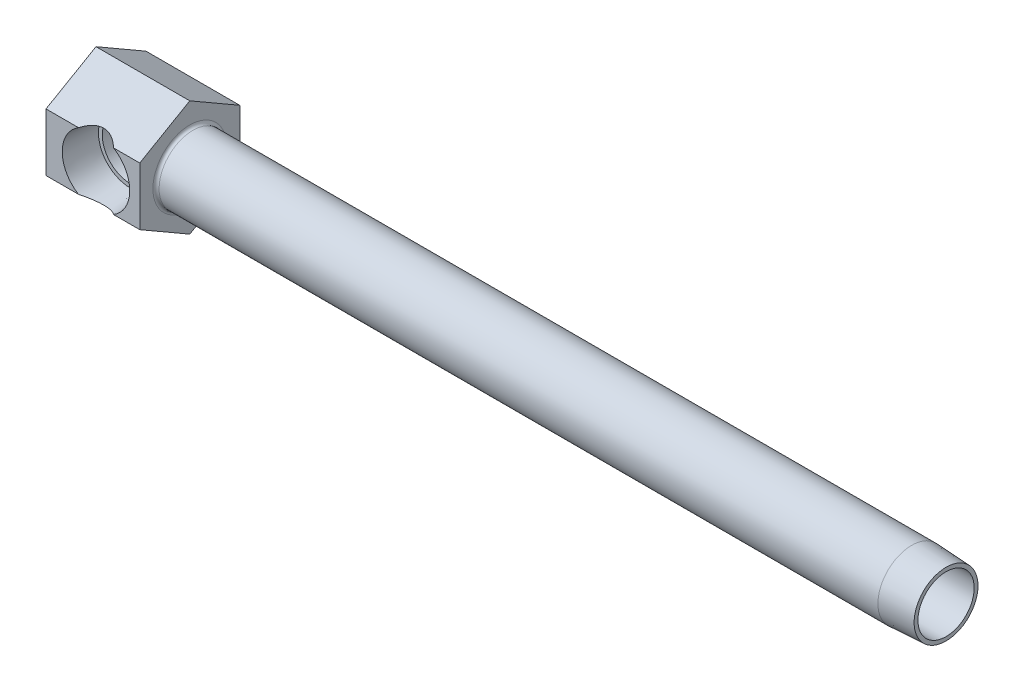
ISO-10303-21;
HEADER;
FILE_DESCRIPTION(('STEP AP214'),'2;1');
FILE_NAME('part.step','',(''),(''),'','','');
FILE_SCHEMA(('AUTOMOTIVE_DESIGN { 1 0 10303 214 1 1 1 1 }'));
ENDSEC;
DATA;
#1=APPLICATION_CONTEXT('core data for automotive mechanical design processes');
#2=APPLICATION_PROTOCOL_DEFINITION('international standard','automotive_design',2000,#1);
#3=PRODUCT_CONTEXT('',#1,'mechanical');
#4=PRODUCT('Part','Part','',(#3));
#5=PRODUCT_RELATED_PRODUCT_CATEGORY('part','',(#4));
#6=PRODUCT_DEFINITION_FORMATION('','',#4);
#7=PRODUCT_DEFINITION_CONTEXT('part definition',#1,'design');
#8=PRODUCT_DEFINITION('design','',#6,#7);
#9=PRODUCT_DEFINITION_SHAPE('','',#8);
#10=(LENGTH_UNIT() NAMED_UNIT(*) SI_UNIT(.MILLI.,.METRE.));
#11=(NAMED_UNIT(*) PLANE_ANGLE_UNIT() SI_UNIT($,.RADIAN.));
#12=(NAMED_UNIT(*) SI_UNIT($,.STERADIAN.) SOLID_ANGLE_UNIT());
#13=UNCERTAINTY_MEASURE_WITH_UNIT(LENGTH_MEASURE(1.E-05),#10,'distance_accuracy_value','');
#14=(GEOMETRIC_REPRESENTATION_CONTEXT(3) GLOBAL_UNCERTAINTY_ASSIGNED_CONTEXT((#13)) GLOBAL_UNIT_ASSIGNED_CONTEXT((#10,
#11,#12)) REPRESENTATION_CONTEXT('',''));
#15=CARTESIAN_POINT('',(0.,0.,0.));
#16=DIRECTION('',(0.,0.,1.));
#17=DIRECTION('',(1.,0.,0.));
#18=AXIS2_PLACEMENT_3D('',#15,#16,#17);
#19=CARTESIAN_POINT('',(63.5,0.,12.7));
#20=DIRECTION('',(-1.,0.,0.));
#21=DIRECTION('',(0.,-1.,0.));
#22=AXIS2_PLACEMENT_3D('',#19,#20,#21);
#23=CYLINDRICAL_SURFACE('',#22,8.5725);
#24=CARTESIAN_POINT('',(24.5999,0.,12.7));
#25=DIRECTION('',(-1.,0.,0.));
#26=DIRECTION('',(0.,-1.,0.));
#27=AXIS2_PLACEMENT_3D('',#24,#25,#26);
#28=CIRCLE('',#27,8.5725);
#29=CARTESIAN_POINT('',(24.5999,-8.57249999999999,12.7));
#30=VERTEX_POINT('',#29);
#31=EDGE_CURVE('E22',#30,#30,#28,.F.);
#32=ORIENTED_EDGE('',*,*,#31,.T.);
#33=EDGE_LOOP('',(#32));
#34=FACE_BOUND('',#33,.T.);
#35=CARTESIAN_POINT('',(207.1624,0.,12.7));
#36=DIRECTION('',(1.,0.,0.));
#37=DIRECTION('',(0.,0.,-1.));
#38=AXIS2_PLACEMENT_3D('',#35,#36,#37);
#39=CIRCLE('',#38,8.5725);
#40=CARTESIAN_POINT('',(207.1624,0.,4.1275));
#41=VERTEX_POINT('',#40);
#42=EDGE_CURVE('E153',#41,#41,#39,.T.);
#43=ORIENTED_EDGE('',*,*,#42,.F.);
#44=EDGE_LOOP('',(#43));
#45=FACE_BOUND('',#44,.T.);
#46=ADVANCED_FACE('F15',(#34,#45),#23,.T.);
#47=CARTESIAN_POINT('',(23.8125,14.6646968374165,12.7));
#48=DIRECTION('',(0.,-0.866025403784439,-0.5));
#49=DIRECTION('',(0.,0.5,-0.866025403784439));
#50=AXIS2_PLACEMENT_3D('',#47,#48,#49);
#51=PLANE('',#50);
#52=CARTESIAN_POINT('',(12.7,-0.84553451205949,39.56450873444));
#53=DIRECTION('',(0.,-0.866025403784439,-0.5));
#54=DIRECTION('',(0.,-0.5,0.866025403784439));
#55=AXIS2_PLACEMENT_3D('',#52,#53,#54);
#56=ELLIPSE('',#55,18.6296608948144,9.27637524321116);
#57=CARTESIAN_POINT('',(17.1412186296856,7.33234841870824,25.4));
#58=VERTEX_POINT('',#57);
#59=CARTESIAN_POINT('',(8.25878137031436,7.33234841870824,25.4));
#60=VERTEX_POINT('',#59);
#61=EDGE_CURVE('E232',#58,#60,#56,.F.);
#62=ORIENTED_EDGE('',*,*,#61,.F.);
#63=DIRECTION('',(-1.,0.,0.));
#64=VECTOR('',#63,1.);
#65=CARTESIAN_POINT('',(23.8125,7.33234841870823,25.4));
#66=LINE('',#65,#64);
#67=CARTESIAN_POINT('',(23.8125,7.33234841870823,25.4));
#68=VERTEX_POINT('',#67);
#69=EDGE_CURVE('E202',#68,#58,#66,.T.);
#70=ORIENTED_EDGE('',*,*,#69,.F.);
#71=DIRECTION('',(0.,-0.5,0.866025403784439));
#72=VECTOR('',#71,1.);
#73=CARTESIAN_POINT('',(23.8125,14.6646968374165,12.7));
#74=LINE('',#73,#72);
#75=CARTESIAN_POINT('',(23.8125,14.6646968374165,12.7));
#76=VERTEX_POINT('',#75);
#77=EDGE_CURVE('E222',#76,#68,#74,.T.);
#78=ORIENTED_EDGE('',*,*,#77,.F.);
#79=DIRECTION('',(-1.,0.,0.));
#80=VECTOR('',#79,1.);
#81=CARTESIAN_POINT('',(23.8125,14.6646968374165,12.7));
#82=LINE('',#81,#80);
#83=CARTESIAN_POINT('',(0.,14.6646968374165,12.7));
#84=VERTEX_POINT('',#83);
#85=EDGE_CURVE('E199',#76,#84,#82,.T.);
#86=ORIENTED_EDGE('',*,*,#85,.T.);
#87=DIRECTION('',(0.,-0.5,0.866025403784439));
#88=VECTOR('',#87,1.);
#89=CARTESIAN_POINT('',(0.,14.6646968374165,12.7));
#90=LINE('',#89,#88);
#91=CARTESIAN_POINT('',(0.,7.33234841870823,25.4));
#92=VERTEX_POINT('',#91);
#93=EDGE_CURVE('E239',#84,#92,#90,.T.);
#94=ORIENTED_EDGE('',*,*,#93,.T.);
#95=EDGE_CURVE('E205',#60,#92,#66,.T.);
#96=ORIENTED_EDGE('',*,*,#95,.F.);
#97=EDGE_LOOP('',(#62,#70,#78,#86,#94,#96));
#98=FACE_BOUND('',#97,.T.);
#99=ADVANCED_FACE('F173',(#98),#51,.F.);
#100=CARTESIAN_POINT('',(23.8125,7.33234841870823,25.4));
#101=DIRECTION('',(0.,0.,-1.));
#102=DIRECTION('',(-1.,0.,0.));
#103=AXIS2_PLACEMENT_3D('',#100,#101,#102);
#104=PLANE('',#103);
#105=CARTESIAN_POINT('',(12.7,0.,25.4));
#106=DIRECTION('',(0.,0.,-1.));
#107=DIRECTION('',(-1.,0.,0.));
#108=AXIS2_PLACEMENT_3D('',#105,#106,#107);
#109=CIRCLE('',#108,8.5725);
#110=CARTESIAN_POINT('',(17.1412186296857,-7.33234841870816,25.4));
#111=VERTEX_POINT('',#110);
#112=EDGE_CURVE('E249',#58,#111,#109,.T.);
#113=ORIENTED_EDGE('',*,*,#112,.T.);
#114=DIRECTION('',(-1.,0.,0.));
#115=VECTOR('',#114,1.);
#116=CARTESIAN_POINT('',(23.8125,-7.33234841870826,25.4));
#117=LINE('',#116,#115);
#118=CARTESIAN_POINT('',(23.8125,-7.33234841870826,25.4));
#119=VERTEX_POINT('',#118);
#120=EDGE_CURVE('E206',#119,#111,#117,.T.);
#121=ORIENTED_EDGE('',*,*,#120,.F.);
#122=DIRECTION('',(0.,-1.,0.));
#123=VECTOR('',#122,1.);
#124=CARTESIAN_POINT('',(23.8125,7.33234841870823,25.4));
#125=LINE('',#124,#123);
#126=EDGE_CURVE('E220',#68,#119,#125,.T.);
#127=ORIENTED_EDGE('',*,*,#126,.F.);
#128=ORIENTED_EDGE('',*,*,#69,.T.);
#129=EDGE_LOOP('',(#113,#121,#127,#128));
#130=FACE_BOUND('',#129,.T.);
#131=ADVANCED_FACE('F179',(#130),#104,.F.);
#132=CARTESIAN_POINT('',(8.25878137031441,-7.33234841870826,25.4));
#133=VERTEX_POINT('',#132);
#134=EDGE_CURVE('E36',#133,#60,#109,.T.);
#135=ORIENTED_EDGE('',*,*,#134,.T.);
#136=ORIENTED_EDGE('',*,*,#95,.T.);
#137=DIRECTION('',(0.,-1.,0.));
#138=VECTOR('',#137,1.);
#139=CARTESIAN_POINT('',(0.,7.33234841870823,25.4));
#140=LINE('',#139,#138);
#141=CARTESIAN_POINT('',(0.,-7.33234841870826,25.4));
#142=VERTEX_POINT('',#141);
#143=EDGE_CURVE('E235',#92,#142,#140,.T.);
#144=ORIENTED_EDGE('',*,*,#143,.T.);
#145=EDGE_CURVE('E209',#133,#142,#117,.T.);
#146=ORIENTED_EDGE('',*,*,#145,.F.);
#147=EDGE_LOOP('',(#135,#136,#144,#146));
#148=FACE_BOUND('',#147,.T.);
#149=ADVANCED_FACE('F285',(#148),#104,.F.);
#150=CARTESIAN_POINT('',(23.8125,-7.33234841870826,25.4));
#151=DIRECTION('',(0.,0.86602540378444,-0.5));
#152=DIRECTION('',(0.,0.5,0.86602540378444));
#153=AXIS2_PLACEMENT_3D('',#150,#151,#152);
#154=PLANE('',#153);
#155=CARTESIAN_POINT('',(12.7,0.845534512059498,39.5645087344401));
#156=DIRECTION('',(0.,0.86602540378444,-0.5));
#157=DIRECTION('',(0.,0.5,0.86602540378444));
#158=AXIS2_PLACEMENT_3D('',#155,#156,#157);
#159=ELLIPSE('',#158,18.6296608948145,9.27637524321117);
#160=EDGE_CURVE('E10',#133,#111,#159,.F.);
#161=ORIENTED_EDGE('',*,*,#160,.F.);
#162=ORIENTED_EDGE('',*,*,#145,.T.);
#163=DIRECTION('',(0.,-0.5,-0.86602540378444));
#164=VECTOR('',#163,1.);
#165=CARTESIAN_POINT('',(0.,-7.33234841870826,25.4));
#166=LINE('',#165,#164);
#167=CARTESIAN_POINT('',(0.,-14.6646968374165,12.7));
#168=VERTEX_POINT('',#167);
#169=EDGE_CURVE('E218',#142,#168,#166,.T.);
#170=ORIENTED_EDGE('',*,*,#169,.T.);
#171=DIRECTION('',(-1.,0.,0.));
#172=VECTOR('',#171,1.);
#173=CARTESIAN_POINT('',(23.8125,-14.6646968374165,12.7));
#174=LINE('',#173,#172);
#175=CARTESIAN_POINT('',(23.8125,-14.6646968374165,12.7));
#176=VERTEX_POINT('',#175);
#177=EDGE_CURVE('E210',#176,#168,#174,.T.);
#178=ORIENTED_EDGE('',*,*,#177,.F.);
#179=DIRECTION('',(0.,-0.5,-0.86602540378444));
#180=VECTOR('',#179,1.);
#181=CARTESIAN_POINT('',(23.8125,-7.33234841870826,25.4));
#182=LINE('',#181,#180);
#183=EDGE_CURVE('E213',#119,#176,#182,.T.);
#184=ORIENTED_EDGE('',*,*,#183,.F.);
#185=ORIENTED_EDGE('',*,*,#120,.T.);
#186=EDGE_LOOP('',(#161,#162,#170,#178,#184,#185));
#187=FACE_BOUND('',#186,.T.);
#188=ADVANCED_FACE('F281',(#187),#154,.F.);
#189=CARTESIAN_POINT('',(23.8125,-14.6646968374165,12.7));
#190=DIRECTION('',(0.,0.866025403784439,0.5));
#191=DIRECTION('',(0.,-0.5,0.866025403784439));
#192=AXIS2_PLACEMENT_3D('',#189,#190,#191);
#193=PLANE('',#192);
#194=DIRECTION('',(0.,0.5,-0.866025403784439));
#195=VECTOR('',#194,1.);
#196=CARTESIAN_POINT('',(0.,-14.6646968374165,12.7));
#197=LINE('',#196,#195);
#198=CARTESIAN_POINT('',(0.,-7.33234841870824,0.));
#199=VERTEX_POINT('',#198);
#200=EDGE_CURVE('E227',#168,#199,#197,.T.);
#201=ORIENTED_EDGE('',*,*,#200,.T.);
#202=DIRECTION('',(-1.,0.,0.));
#203=VECTOR('',#202,1.);
#204=CARTESIAN_POINT('',(23.8125,-7.33234841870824,0.));
#205=LINE('',#204,#203);
#206=CARTESIAN_POINT('',(23.8125,-7.33234841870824,0.));
#207=VERTEX_POINT('',#206);
#208=EDGE_CURVE('E191',#207,#199,#205,.T.);
#209=ORIENTED_EDGE('',*,*,#208,.F.);
#210=DIRECTION('',(0.,0.5,-0.866025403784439));
#211=VECTOR('',#210,1.);
#212=CARTESIAN_POINT('',(23.8125,-14.6646968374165,12.7));
#213=LINE('',#212,#211);
#214=EDGE_CURVE('E214',#176,#207,#213,.T.);
#215=ORIENTED_EDGE('',*,*,#214,.F.);
#216=ORIENTED_EDGE('',*,*,#177,.T.);
#217=EDGE_LOOP('',(#201,#209,#215,#216));
#218=FACE_BOUND('',#217,.T.);
#219=ADVANCED_FACE('F284',(#218),#193,.F.);
#220=CARTESIAN_POINT('',(23.8125,-7.33234841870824,0.));
#221=DIRECTION('',(0.,0.,1.));
#222=DIRECTION('',(0.,-1.,0.));
#223=AXIS2_PLACEMENT_3D('',#220,#221,#222);
#224=PLANE('',#223);
#225=DIRECTION('',(0.,1.,0.));
#226=VECTOR('',#225,1.);
#227=CARTESIAN_POINT('',(0.,-7.33234841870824,0.));
#228=LINE('',#227,#226);
#229=CARTESIAN_POINT('',(0.,7.33234841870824,0.));
#230=VERTEX_POINT('',#229);
#231=EDGE_CURVE('E231',#199,#230,#228,.T.);
#232=ORIENTED_EDGE('',*,*,#231,.T.);
#233=DIRECTION('',(-1.,0.,0.));
#234=VECTOR('',#233,1.);
#235=CARTESIAN_POINT('',(23.8125,7.33234841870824,0.));
#236=LINE('',#235,#234);
#237=CARTESIAN_POINT('',(23.8125,7.33234841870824,0.));
#238=VERTEX_POINT('',#237);
#239=EDGE_CURVE('E196',#238,#230,#236,.T.);
#240=ORIENTED_EDGE('',*,*,#239,.F.);
#241=DIRECTION('',(0.,1.,0.));
#242=VECTOR('',#241,1.);
#243=CARTESIAN_POINT('',(23.8125,-7.33234841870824,0.));
#244=LINE('',#243,#242);
#245=EDGE_CURVE('E217',#207,#238,#244,.T.);
#246=ORIENTED_EDGE('',*,*,#245,.F.);
#247=ORIENTED_EDGE('',*,*,#208,.T.);
#248=EDGE_LOOP('',(#232,#240,#246,#247));
#249=FACE_BOUND('',#248,.T.);
#250=ADVANCED_FACE('F292',(#249),#224,.F.);
#251=CARTESIAN_POINT('',(23.8125,7.33234841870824,0.));
#252=DIRECTION('',(0.,-0.866025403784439,0.5));
#253=DIRECTION('',(0.,-0.5,-0.866025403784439));
#254=AXIS2_PLACEMENT_3D('',#251,#252,#253);
#255=PLANE('',#254);
#256=DIRECTION('',(0.,0.5,0.866025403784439));
#257=VECTOR('',#256,1.);
#258=CARTESIAN_POINT('',(0.,7.33234841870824,0.));
#259=LINE('',#258,#257);
#260=EDGE_CURVE('E243',#230,#84,#259,.T.);
#261=ORIENTED_EDGE('',*,*,#260,.T.);
#262=ORIENTED_EDGE('',*,*,#85,.F.);
#263=DIRECTION('',(0.,0.5,0.866025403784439));
#264=VECTOR('',#263,1.);
#265=CARTESIAN_POINT('',(23.8125,7.33234841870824,0.));
#266=LINE('',#265,#264);
#267=EDGE_CURVE('E224',#238,#76,#266,.T.);
#268=ORIENTED_EDGE('',*,*,#267,.F.);
#269=ORIENTED_EDGE('',*,*,#239,.T.);
#270=EDGE_LOOP('',(#261,#262,#268,#269));
#271=FACE_BOUND('',#270,.T.);
#272=ADVANCED_FACE('F279',(#271),#255,.F.);
#273=CARTESIAN_POINT('',(23.8125,-21.9970452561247,25.4));
#274=DIRECTION('',(-1.,0.,0.));
#275=DIRECTION('',(0.,-1.,0.));
#276=AXIS2_PLACEMENT_3D('',#273,#274,#275);
#277=PLANE('',#276);
#278=CARTESIAN_POINT('',(23.8125,0.,12.7));
#279=DIRECTION('',(-1.,0.,0.));
#280=DIRECTION('',(0.,-1.,0.));
#281=AXIS2_PLACEMENT_3D('',#278,#279,#280);
#282=CIRCLE('',#281,9.3599);
#283=CARTESIAN_POINT('',(23.8125,-9.35989999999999,12.7));
#284=VERTEX_POINT('',#283);
#285=EDGE_CURVE('E189',#284,#284,#282,.T.);
#286=ORIENTED_EDGE('',*,*,#285,.T.);
#287=EDGE_LOOP('',(#286));
#288=FACE_BOUND('',#287,.T.);
#289=ORIENTED_EDGE('',*,*,#214,.T.);
#290=ORIENTED_EDGE('',*,*,#245,.T.);
#291=ORIENTED_EDGE('',*,*,#267,.T.);
#292=ORIENTED_EDGE('',*,*,#77,.T.);
#293=ORIENTED_EDGE('',*,*,#126,.T.);
#294=ORIENTED_EDGE('',*,*,#183,.T.);
#295=EDGE_LOOP('',(#289,#290,#291,#292,#293,#294));
#296=FACE_BOUND('',#295,.T.);
#297=ADVANCED_FACE('F275',(#288,#296),#277,.F.);
#298=CARTESIAN_POINT('',(0.,-21.9970452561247,25.4));
#299=DIRECTION('',(-1.,0.,0.));
#300=DIRECTION('',(0.,-1.,0.));
#301=AXIS2_PLACEMENT_3D('',#298,#299,#300);
#302=PLANE('',#301);
#303=ORIENTED_EDGE('',*,*,#200,.F.);
#304=ORIENTED_EDGE('',*,*,#169,.F.);
#305=ORIENTED_EDGE('',*,*,#143,.F.);
#306=ORIENTED_EDGE('',*,*,#93,.F.);
#307=ORIENTED_EDGE('',*,*,#260,.F.);
#308=ORIENTED_EDGE('',*,*,#231,.F.);
#309=EDGE_LOOP('',(#303,#304,#305,#306,#307,#308));
#310=FACE_BOUND('',#309,.T.);
#311=ADVANCED_FACE('F272',(#310),#302,.T.);
#312=CARTESIAN_POINT('',(24.5999,0.,12.7));
#313=DIRECTION('',(-1.,0.,0.));
#314=DIRECTION('',(0.,-1.,0.));
#315=AXIS2_PLACEMENT_3D('',#312,#313,#314);
#316=TOROIDAL_SURFACE('',#315,9.3599,0.7874);
#317=ORIENTED_EDGE('',*,*,#31,.F.);
#318=EDGE_LOOP('',(#317));
#319=FACE_BOUND('',#318,.T.);
#320=ORIENTED_EDGE('',*,*,#285,.F.);
#321=EDGE_LOOP('',(#320));
#322=FACE_BOUND('',#321,.T.);
#323=ADVANCED_FACE('F269',(#319,#322),#316,.F.);
#324=CARTESIAN_POINT('',(12.7,0.,25.4));
#325=DIRECTION('',(0.,0.,1.));
#326=DIRECTION('',(1.,0.,0.));
#327=AXIS2_PLACEMENT_3D('',#324,#325,#326);
#328=CONICAL_SURFACE('',#327,8.5725,0.0523598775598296);
#329=CARTESIAN_POINT('',(18.2237788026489,-5.94425228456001,16.6622));
#330=CARTESIAN_POINT('',(18.2916176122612,-5.88732299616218,16.7476009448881));
#331=CARTESIAN_POINT('',(18.3592795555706,-5.82850059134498,16.8318676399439));
#332=CARTESIAN_POINT('',(18.4939968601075,-5.70702027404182,16.9981035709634));
#333=CARTESIAN_POINT('',(18.5610521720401,-5.64436205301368,17.0800726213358));
#334=CARTESIAN_POINT('',(18.761107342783,-5.45038497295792,17.3227058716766));
#335=CARTESIAN_POINT('',(18.8927964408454,-5.31322998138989,17.479846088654));
#336=CARTESIAN_POINT('',(19.1518580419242,-5.0216447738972,17.785397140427));
#337=CARTESIAN_POINT('',(19.2791735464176,-4.8670541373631,17.933703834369));
#338=CARTESIAN_POINT('',(19.5257752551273,-4.5416930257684,18.2184184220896));
#339=CARTESIAN_POINT('',(19.6450670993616,-4.37093412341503,18.35483469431));
#340=CARTESIAN_POINT('',(19.9295445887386,-3.92497659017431,18.6779693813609));
#341=CARTESIAN_POINT('',(20.0885588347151,-3.63961711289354,18.8565618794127));
#342=CARTESIAN_POINT('',(20.3031266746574,-3.18637161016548,19.0960411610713));
#343=CARTESIAN_POINT('',(20.3705741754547,-3.03133869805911,19.1710418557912));
#344=CARTESIAN_POINT('',(20.4965477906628,-2.71316594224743,19.3107517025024));
#345=CARTESIAN_POINT('',(20.5550753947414,-2.55002745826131,19.3754625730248));
#346=CARTESIAN_POINT('',(20.6538405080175,-2.24208944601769,19.4844409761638));
#347=CARTESIAN_POINT('',(20.6955064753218,-2.09831594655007,19.5303217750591));
#348=CARTESIAN_POINT('',(20.7709604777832,-1.80624508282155,19.6132970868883));
#349=CARTESIAN_POINT('',(20.8047499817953,-1.65794856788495,19.6503932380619));
#350=CARTESIAN_POINT('',(20.8638747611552,-1.35762804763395,19.7152415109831));
#351=CARTESIAN_POINT('',(20.8892082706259,-1.20560327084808,19.7429916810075));
#352=CARTESIAN_POINT('',(20.9309344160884,-0.898862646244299,19.7886706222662));
#353=CARTESIAN_POINT('',(20.9473269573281,-0.744146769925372,19.8065992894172));
#354=CARTESIAN_POINT('',(20.9708773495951,-0.43270553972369,19.8323499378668));
#355=CARTESIAN_POINT('',(20.9780075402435,-0.275975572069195,19.8401416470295));
#356=CARTESIAN_POINT('',(20.9827943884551,0.0378027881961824,19.8453730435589));
#357=CARTESIAN_POINT('',(20.9804510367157,0.194851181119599,19.8428127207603));
#358=CARTESIAN_POINT('',(20.9663398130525,0.508011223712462,19.8273884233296));
#359=CARTESIAN_POINT('',(20.9545719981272,0.664122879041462,19.8145245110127));
#360=CARTESIAN_POINT('',(20.9218545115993,0.974205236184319,19.77873224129));
#361=CARTESIAN_POINT('',(20.9009049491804,1.12817596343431,19.755804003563));
#362=CARTESIAN_POINT('',(20.8514678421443,1.42545941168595,19.701637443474));
#363=CARTESIAN_POINT('',(20.8233975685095,1.56892578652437,19.670858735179));
#364=CARTESIAN_POINT('',(20.7597875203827,1.85215468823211,19.6010144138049));
#365=CARTESIAN_POINT('',(20.7242449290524,1.99191579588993,19.5619456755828));
#366=CARTESIAN_POINT('',(20.6072066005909,2.40450989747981,19.4330773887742));
#367=CARTESIAN_POINT('',(20.5152596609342,2.67089071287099,19.3315714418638));
#368=CARTESIAN_POINT('',(20.3408066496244,3.10208873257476,19.1379689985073));
#369=CARTESIAN_POINT('',(20.2643220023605,3.27264094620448,19.0528363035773));
#370=CARTESIAN_POINT('',(20.1020422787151,3.60309741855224,18.8714152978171));
#371=CARTESIAN_POINT('',(20.0162439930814,3.76299797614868,18.7751231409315));
#372=CARTESIAN_POINT('',(19.7465644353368,4.22699236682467,18.4708514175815));
#373=CARTESIAN_POINT('',(19.550728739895,4.51459085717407,18.2478400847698));
#374=CARTESIAN_POINT('',(19.2565333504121,4.89305951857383,17.9071622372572));
#375=CARTESIAN_POINT('',(19.1663785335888,5.00247887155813,17.8020703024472));
#376=CARTESIAN_POINT('',(18.9830153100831,5.21324568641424,17.5865045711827));
#377=CARTESIAN_POINT('',(18.8898069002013,5.31459313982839,17.4760307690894));
#378=CARTESIAN_POINT('',(18.7018932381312,5.50848003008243,17.2510129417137));
#379=CARTESIAN_POINT('',(18.6072061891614,5.60108407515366,17.1365090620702));
#380=CARTESIAN_POINT('',(18.4163909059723,5.77848578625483,16.9028222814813));
#381=CARTESIAN_POINT('',(18.320263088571,5.86328566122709,16.783640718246));
#382=CARTESIAN_POINT('',(18.2237788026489,5.94425228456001,16.6622));
#383=B_SPLINE_CURVE_WITH_KNOTS('',3,(#329,#330,#331,#332,#333,#334,#335,#336,#337,#338,#339,
#340,#341,#342,#343,#344,#345,#346,#347,#348,#349,#350,#351,#352,#353,#354,#355,#356,#357,#358,
#359,#360,#361,#362,#363,#364,#365,#366,#367,#368,#369,#370,#371,#372,#373,#374,#375,#376,#377,
#378,#379,#380,#381,#382),.UNSPECIFIED.,.F.,.F.,(4,2,2,2,2,2,2,2,2,2,2,2,2,2,2,2,2,2,2,2,2,2,2,
2,2,2,4),(0.,0.369050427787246,0.738130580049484,1.47737063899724,2.22407355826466,
2.97024599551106,4.0822255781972,4.63656388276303,5.19080950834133,5.66002823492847,
6.12915938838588,6.59838844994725,7.0676224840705,7.53825460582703,8.00888718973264,
8.47951692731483,8.95014106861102,9.3978219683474,9.8456719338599,10.7406458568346,
11.3560801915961,11.9717272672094,13.2057730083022,13.7350494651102,14.2643264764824,
14.7893227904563,15.3141700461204),.UNSPECIFIED.);
#384=CARTESIAN_POINT('',(18.2239376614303,-5.94411896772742,16.6624));
#385=VERTEX_POINT('',#384);
#386=CARTESIAN_POINT('',(18.2239376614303,5.94411896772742,16.6624));
#387=VERTEX_POINT('',#386);
#388=EDGE_CURVE('E128',#385,#387,#383,.T.);
#389=ORIENTED_EDGE('',*,*,#388,.F.);
#390=CARTESIAN_POINT('',(12.7,0.,16.6624));
#391=DIRECTION('',(0.,0.,-1.));
#392=DIRECTION('',(-1.,0.,0.));
#393=AXIS2_PLACEMENT_3D('',#390,#391,#392);
#394=CIRCLE('',#393,8.1145817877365);
#395=EDGE_CURVE('E251',#385,#387,#394,.T.);
#396=ORIENTED_EDGE('',*,*,#395,.T.);
#397=EDGE_LOOP('',(#389,#396));
#398=FACE_BOUND('',#397,.T.);
#399=ORIENTED_EDGE('',*,*,#61,.T.);
#400=ORIENTED_EDGE('',*,*,#134,.F.);
#401=ORIENTED_EDGE('',*,*,#160,.T.);
#402=ORIENTED_EDGE('',*,*,#112,.F.);
#403=EDGE_LOOP('',(#399,#400,#401,#402));
#404=FACE_BOUND('',#403,.T.);
#405=ADVANCED_FACE('F136',(#398,#404),#328,.F.);
#406=CARTESIAN_POINT('',(20.8145817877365,0.,16.6624));
#407=DIRECTION('',(0.,0.,1.));
#408=DIRECTION('',(1.,0.,0.));
#409=AXIS2_PLACEMENT_3D('',#406,#407,#408);
#410=PLANE('',#409);
#411=DIRECTION('',(1.,0.,0.));
#412=VECTOR('',#411,1.);
#413=CARTESIAN_POINT('',(66.667520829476,-5.94411896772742,16.6624));
#414=LINE('',#413,#412);
#415=CARTESIAN_POINT('',(16.6624,-5.9441189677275,16.6624));
#416=VERTEX_POINT('',#415);
#417=EDGE_CURVE('E123',#416,#385,#414,.T.);
#418=ORIENTED_EDGE('',*,*,#417,.F.);
#419=CARTESIAN_POINT('',(12.7,0.,16.6624));
#420=DIRECTION('',(0.,0.,-1.));
#421=DIRECTION('',(-1.,0.,0.));
#422=AXIS2_PLACEMENT_3D('',#419,#420,#421);
#423=CIRCLE('',#422,7.14375);
#424=CARTESIAN_POINT('',(16.6624,5.9441189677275,16.6624));
#425=VERTEX_POINT('',#424);
#426=EDGE_CURVE('E119',#416,#425,#423,.T.);
#427=ORIENTED_EDGE('',*,*,#426,.T.);
#428=DIRECTION('',(1.,0.,0.));
#429=VECTOR('',#428,1.);
#430=CARTESIAN_POINT('',(66.667520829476,5.94411896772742,16.6624));
#431=LINE('',#430,#429);
#432=EDGE_CURVE('E120',#387,#425,#431,.F.);
#433=ORIENTED_EDGE('',*,*,#432,.F.);
#434=ORIENTED_EDGE('',*,*,#395,.F.);
#435=EDGE_LOOP('',(#418,#427,#433,#434));
#436=FACE_BOUND('',#435,.T.);
#437=ADVANCED_FACE('F262',(#436),#410,.T.);
#438=CARTESIAN_POINT('',(12.7,0.,34.595573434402));
#439=DIRECTION('',(0.,0.,-1.));
#440=DIRECTION('',(-1.,0.,0.));
#441=AXIS2_PLACEMENT_3D('',#438,#439,#440);
#442=CYLINDRICAL_SURFACE('',#441,7.14375);
#443=CARTESIAN_POINT('',(12.7,0.,12.7));
#444=DIRECTION('',(0.707106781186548,0.,-0.707106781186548));
#445=DIRECTION('',(-0.707106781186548,0.,-0.707106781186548));
#446=AXIS2_PLACEMENT_3D('',#443,#444,#445);
#447=ELLIPSE('',#446,10.1027881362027,7.14375);
#448=CARTESIAN_POINT('',(12.7,7.14375,12.7));
#449=VERTEX_POINT('',#448);
#450=EDGE_CURVE('E121',#425,#449,#447,.F.);
#451=ORIENTED_EDGE('',*,*,#450,.F.);
#452=ORIENTED_EDGE('',*,*,#426,.F.);
#453=CARTESIAN_POINT('',(12.7,-7.14375,12.7));
#454=VERTEX_POINT('',#453);
#455=EDGE_CURVE('E108',#454,#416,#447,.F.);
#456=ORIENTED_EDGE('',*,*,#455,.F.);
#457=CARTESIAN_POINT('',(12.7,0.,12.7));
#458=DIRECTION('',(-0.707106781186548,0.,-0.707106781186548));
#459=DIRECTION('',(0.707106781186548,0.,-0.707106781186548));
#460=AXIS2_PLACEMENT_3D('',#457,#458,#459);
#461=ELLIPSE('',#460,10.1027881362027,7.14375);
#462=CARTESIAN_POINT('',(18.1005540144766,-4.67623570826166,7.2994459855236));
#463=VERTEX_POINT('',#462);
#464=EDGE_CURVE('E104',#463,#454,#461,.T.);
#465=ORIENTED_EDGE('',*,*,#464,.F.);
#466=CARTESIAN_POINT('',(12.7,0.,7.2994459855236));
#467=DIRECTION('',(0.,0.,-1.));
#468=DIRECTION('',(-1.,0.,0.));
#469=AXIS2_PLACEMENT_3D('',#466,#467,#468);
#470=CIRCLE('',#469,7.14375);
#471=CARTESIAN_POINT('',(18.1005540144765,4.67623570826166,7.2994459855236));
#472=VERTEX_POINT('',#471);
#473=EDGE_CURVE('E134',#463,#472,#470,.T.);
#474=ORIENTED_EDGE('',*,*,#473,.T.);
#475=EDGE_CURVE('E29',#449,#472,#461,.T.);
#476=ORIENTED_EDGE('',*,*,#475,.F.);
#477=EDGE_LOOP('',(#451,#452,#456,#465,#474,#476));
#478=FACE_BOUND('',#477,.T.);
#479=ADVANCED_FACE('F117',(#478),#442,.F.);
#480=CARTESIAN_POINT('',(12.7,0.,7.2994459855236));
#481=DIRECTION('',(0.,0.,1.));
#482=DIRECTION('',(1.,0.,0.));
#483=AXIS2_PLACEMENT_3D('',#480,#481,#482);
#484=CONICAL_SURFACE('',#483,7.14375,1.0471975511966);
#485=CARTESIAN_POINT('',(18.1008122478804,4.67646667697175,7.29964598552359));
#486=CARTESIAN_POINT('',(18.0182484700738,4.60263120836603,7.23572166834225));
#487=CARTESIAN_POINT('',(17.9383238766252,4.52571856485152,7.17175555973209));
#488=CARTESIAN_POINT('',(17.7848563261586,4.36518020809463,7.0441228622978));
#489=CARTESIAN_POINT('',(17.7113260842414,4.28154172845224,6.98045709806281));
#490=CARTESIAN_POINT('',(17.5726476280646,4.1079855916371,6.8545747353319));
#491=CARTESIAN_POINT('',(17.5074361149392,4.01812452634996,6.79235056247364));
#492=CARTESIAN_POINT('',(17.3859720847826,3.83151153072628,6.66964834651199));
#493=CARTESIAN_POINT('',(17.3297132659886,3.73476451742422,6.60916909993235));
#494=CARTESIAN_POINT('',(17.2264163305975,3.53345239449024,6.49019348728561));
#495=CARTESIAN_POINT('',(17.1794940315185,3.42880893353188,6.43172867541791));
#496=CARTESIAN_POINT('',(17.0960237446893,3.21346156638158,6.31865082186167));
#497=CARTESIAN_POINT('',(17.0594774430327,3.10275667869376,6.26403840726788));
#498=CARTESIAN_POINT('',(16.996254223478,2.87633249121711,6.15970832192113));
#499=CARTESIAN_POINT('',(16.9695794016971,2.76061213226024,6.10999169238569));
#500=CARTESIAN_POINT('',(16.9248366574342,2.52527852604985,6.01627423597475));
#501=CARTESIAN_POINT('',(16.9067703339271,2.40566455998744,5.97227447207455));
#502=CARTESIAN_POINT('',(16.872150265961,2.11917129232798,5.87557836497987));
#503=CARTESIAN_POINT('',(16.8585719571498,1.95102064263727,5.82559588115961));
#504=CARTESIAN_POINT('',(16.8395248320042,1.61106163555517,5.73806695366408));
#505=CARTESIAN_POINT('',(16.834060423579,1.43925134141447,5.70052727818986));
#506=CARTESIAN_POINT('',(16.8272216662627,1.09272483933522,5.63811598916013));
#507=CARTESIAN_POINT('',(16.8258602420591,0.918001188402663,5.61328461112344));
#508=CARTESIAN_POINT('',(16.8244844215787,0.567245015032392,5.576623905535));
#509=CARTESIAN_POINT('',(16.8244696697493,0.391212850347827,5.56479114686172));
#510=CARTESIAN_POINT('',(16.8244315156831,0.0298631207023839,5.55391234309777));
#511=CARTESIAN_POINT('',(16.8244077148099,-0.155475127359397,5.55554105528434));
#512=CARTESIAN_POINT('',(16.8245481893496,-0.525517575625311,5.57319743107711));
#513=CARTESIAN_POINT('',(16.8247125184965,-0.710221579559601,5.58922920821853));
#514=CARTESIAN_POINT('',(16.8272365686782,-1.07761401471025,5.63557061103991));
#515=CARTESIAN_POINT('',(16.8295939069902,-1.26030441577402,5.66586472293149));
#516=CARTESIAN_POINT('',(16.8402108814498,-1.62260116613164,5.74051131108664));
#517=CARTESIAN_POINT('',(16.8484676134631,-1.80220898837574,5.78485686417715));
#518=CARTESIAN_POINT('',(16.8713785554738,-2.09762253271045,5.87004472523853));
#519=CARTESIAN_POINT('',(16.8829850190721,-2.21474934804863,5.90713222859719));
#520=CARTESIAN_POINT('',(16.9127302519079,-2.44618190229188,5.98700326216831));
#521=CARTESIAN_POINT('',(16.9308663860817,-2.56048875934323,6.02978449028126));
#522=CARTESIAN_POINT('',(16.9750927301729,-2.78506409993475,6.12039584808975));
#523=CARTESIAN_POINT('',(17.0011553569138,-2.89534512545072,6.16820809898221));
#524=CARTESIAN_POINT('',(17.0623258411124,-3.11130073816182,6.26827147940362));
#525=CARTESIAN_POINT('',(17.0974329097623,-3.21697572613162,6.3205222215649));
#526=CARTESIAN_POINT('',(17.1773511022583,-3.42340093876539,6.42886299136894));
#527=CARTESIAN_POINT('',(17.2222166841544,-3.52411947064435,6.48497330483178));
#528=CARTESIAN_POINT('',(17.3212699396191,-3.71931545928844,6.59977977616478));
#529=CARTESIAN_POINT('',(17.3754591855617,-3.81379185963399,6.65847636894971));
#530=CARTESIAN_POINT('',(17.4924791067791,-3.99641031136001,6.77768652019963));
#531=CARTESIAN_POINT('',(17.5553313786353,-4.08453566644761,6.83820431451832));
#532=CARTESIAN_POINT('',(17.6884734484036,-4.25426378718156,6.96019752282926));
#533=CARTESIAN_POINT('',(17.758764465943,-4.3358654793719,7.02167309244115));
#534=CARTESIAN_POINT('',(17.8750599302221,-4.46018946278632,7.11938400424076));
#535=CARTESIAN_POINT('',(17.9190095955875,-4.5049692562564,7.15548532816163));
#536=CARTESIAN_POINT('',(18.0086324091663,-4.59230195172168,7.22760435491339));
#537=CARTESIAN_POINT('',(18.0542970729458,-4.6348638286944,7.26362172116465));
#538=CARTESIAN_POINT('',(18.1008122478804,-4.67646667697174,7.29964598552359));
#539=B_SPLINE_CURVE_WITH_KNOTS('',3,(#485,#486,#487,#488,#489,#490,#491,#492,#493,#494,#495,
#496,#497,#498,#499,#500,#501,#502,#503,#504,#505,#506,#507,#508,#509,#510,#511,#512,#513,#514,
#515,#516,#517,#518,#519,#520,#521,#522,#523,#524,#525,#526,#527,#528,#529,#530,#531,#532,#533,
#534,#535,#536,#537,#538),.UNSPECIFIED.,.F.,.F.,(4,2,2,2,2,2,2,2,2,2,2,2,2,2,2,2,2,2,2,2,2,2,2,
2,2,2,4),(0.,0.383734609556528,0.768215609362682,1.14957007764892,1.530654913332,
1.91620690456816,2.30182151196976,2.68751795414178,3.07328600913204,3.60029069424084,
4.12758157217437,4.65653172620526,5.18534222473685,5.74081422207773,6.29644491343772,
6.8514726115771,7.40622727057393,7.77616444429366,8.14595249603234,8.5144681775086,
8.8829517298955,9.25354694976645,9.62420472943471,9.99580384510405,10.3674639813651,
10.5845818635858,10.8007392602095),.UNSPECIFIED.);
#540=EDGE_CURVE('E110',#472,#463,#539,.T.);
#541=ORIENTED_EDGE('',*,*,#540,.F.);
#542=ORIENTED_EDGE('',*,*,#473,.F.);
#543=EDGE_LOOP('',(#541,#542));
#544=FACE_BOUND('',#543,.T.);
#545=CARTESIAN_POINT('',(12.7,0.,3.1750000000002));
#546=VERTEX_POINT('',#545);
#547=VERTEX_LOOP('',#546);
#548=FACE_BOUND('',#547,.T.);
#549=ADVANCED_FACE('F144',(#544,#548),#484,.F.);
#550=CARTESIAN_POINT('',(66.667520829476,0.,12.7));
#551=DIRECTION('',(1.,0.,0.));
#552=DIRECTION('',(0.,0.,-1.));
#553=AXIS2_PLACEMENT_3D('',#550,#551,#552);
#554=CYLINDRICAL_SURFACE('',#553,7.1437499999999);
#555=ORIENTED_EDGE('',*,*,#388,.T.);
#556=ORIENTED_EDGE('',*,*,#432,.T.);
#557=ORIENTED_EDGE('',*,*,#450,.T.);
#558=ORIENTED_EDGE('',*,*,#475,.T.);
#559=ORIENTED_EDGE('',*,*,#540,.T.);
#560=ORIENTED_EDGE('',*,*,#464,.T.);
#561=ORIENTED_EDGE('',*,*,#455,.T.);
#562=ORIENTED_EDGE('',*,*,#417,.T.);
#563=EDGE_LOOP('',(#555,#556,#557,#558,#559,#560,#561,#562));
#564=FACE_BOUND('',#563,.T.);
#565=CARTESIAN_POINT('',(215.9,0.,12.7));
#566=DIRECTION('',(1.,0.,0.));
#567=DIRECTION('',(0.,0.,-1.));
#568=AXIS2_PLACEMENT_3D('',#565,#566,#567);
#569=CIRCLE('',#568,7.1437499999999);
#570=CARTESIAN_POINT('',(215.9,0.,5.5562500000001));
#571=VERTEX_POINT('',#570);
#572=EDGE_CURVE('E159',#571,#571,#569,.T.);
#573=ORIENTED_EDGE('',*,*,#572,.T.);
#574=EDGE_LOOP('',(#573));
#575=FACE_BOUND('',#574,.T.);
#576=ADVANCED_FACE('F106',(#564,#575),#554,.F.);
#577=CARTESIAN_POINT('',(215.9,0.,12.7));
#578=DIRECTION('',(-1.,0.,0.));
#579=DIRECTION('',(0.,0.,1.));
#580=AXIS2_PLACEMENT_3D('',#577,#578,#579);
#581=CONICAL_SURFACE('',#580,8.11458178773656,0.052359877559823);
#582=ORIENTED_EDGE('',*,*,#42,.T.);
#583=EDGE_LOOP('',(#582));
#584=FACE_BOUND('',#583,.T.);
#585=CARTESIAN_POINT('',(215.9,0.,12.7));
#586=DIRECTION('',(1.,0.,0.));
#587=DIRECTION('',(0.,0.,-1.));
#588=AXIS2_PLACEMENT_3D('',#585,#586,#587);
#589=CIRCLE('',#588,8.11458178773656);
#590=CARTESIAN_POINT('',(215.9,0.,4.58541821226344));
#591=VERTEX_POINT('',#590);
#592=EDGE_CURVE('E156',#591,#591,#589,.T.);
#593=ORIENTED_EDGE('',*,*,#592,.F.);
#594=EDGE_LOOP('',(#593));
#595=FACE_BOUND('',#594,.T.);
#596=ADVANCED_FACE('F143',(#584,#595),#581,.T.);
#597=CARTESIAN_POINT('',(215.9,0.,5.5562500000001));
#598=DIRECTION('',(1.,0.,0.));
#599=DIRECTION('',(0.,0.,-1.));
#600=AXIS2_PLACEMENT_3D('',#597,#598,#599);
#601=PLANE('',#600);
#602=ORIENTED_EDGE('',*,*,#592,.T.);
#603=EDGE_LOOP('',(#602));
#604=FACE_BOUND('',#603,.T.);
#605=ORIENTED_EDGE('',*,*,#572,.F.);
#606=EDGE_LOOP('',(#605));
#607=FACE_BOUND('',#606,.T.);
#608=ADVANCED_FACE('F163',(#604,#607),#601,.T.);
#609=CLOSED_SHELL('',(#46,#99,#131,#149,#188,#219,#250,#272,#297,#311,#323,#405,#437,#479,#549,
#576,#596,#608));
#610=MANIFOLD_SOLID_BREP('B1',#609);
#611=ADVANCED_BREP_SHAPE_REPRESENTATION('',(#18,#610),#14);
#612=SHAPE_DEFINITION_REPRESENTATION(#9,#611);
ENDSEC;
END-ISO-10303-21;
